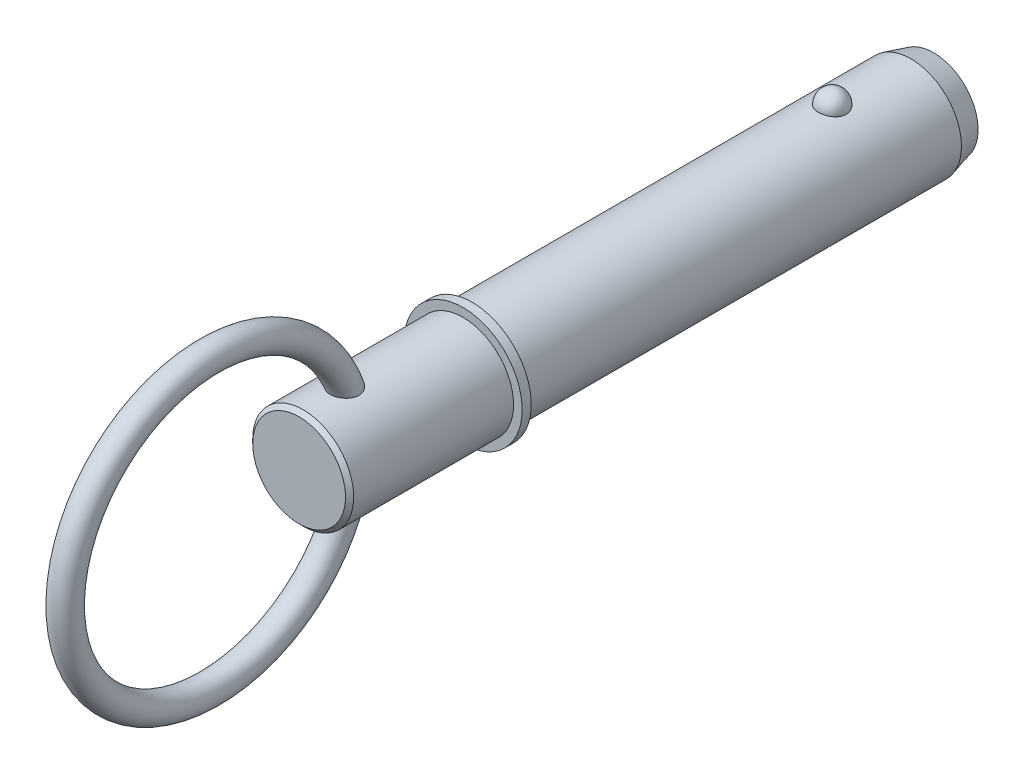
from build123d import *

# Parameters (mm, degrees)
SKETCH2_R           = 11.115
BOSS_EXTRUDE1_DEPTH = 76.2
BOSS_EXTRUDE2_START = 25.4
SKETCH3_R           = 11.115
BOSS_EXTRUDE2_DEPTH = 25.4
CHAMFER1_SIZE       = 5
CHAMFER1_SIZE2      = 1.339745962
SKETCH20_W          = 2
SKETCH20_H          = 13
SKETCH21_R          = 11.115
BOSS_EXTRUDE3_DEPTH = 38.1
CHAMFER2_SIZE       = 0.9
SKETCH24_R          = 3


with BuildPart() as part:
    # Sketch2 → Boss-Extrude1 (new body)
    with BuildSketch(Plane.XY):
        with Locations(Location((0, 0, 0), (0, 0, 180))):
            Circle(SKETCH2_R)
    extrude(amount=BOSS_EXTRUDE1_DEPTH)

    # Sketch3 → Boss-Extrude2 (add)
    with BuildSketch(Plane(origin=(0, 0, 0), x_dir=(-1, 0, 0), z_dir=(0, 0, -1)).offset(BOSS_EXTRUDE2_START)):
        Circle(SKETCH3_R)
    extrude(amount=-BOSS_EXTRUDE2_DEPTH)

    # Chamfer1
    chamfer1_edges = [part.edges().sort_by_distance(p)[0] for p in [
        (11.115, 0, -25.4),
    ]]
    chamfer1_side = [part.faces().sort_by_distance(p)[0] for p in [
        (11.115, 0, 25.4),
    ]]
    chamfer(chamfer1_edges, length=CHAMFER1_SIZE, length2=CHAMFER1_SIZE2, reference=chamfer1_side[0])

    # Sketch18 → Revolve1 (revolve)
    with BuildSketch(Plane(origin=(0, 0, 0), x_dir=(0, 0, -1), z_dir=(1, 0, 0))):
        with BuildLine():
            Line((3.07, 14.185), (3.07, 8.045))
            ThreePointArc((3.07, 8.045), (0, 11.115), (3.07, 14.185))
        make_face()
    revolve(axis=Axis((0, 14.185, -3.07), (0, -1, 0)))

    # Sketch20 → Revolve2 (revolve)
    with BuildSketch(Plane(origin=(0, 0, 0), x_dir=(0, 0, -1), z_dir=(1, 0, 0)), mode=Mode.PRIVATE) as revolve2_sk:
        with Locations((-77.2, 6.5)):
            Rectangle(SKETCH20_W, SKETCH20_H)
    revolve(revolve2_sk.sketch.rotate(Axis((0, 0, 33.728787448), (0, 0, 1)), 90), axis=Axis((0, 0, 33.728787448), (0, 0, 1)))

    # Sketch21 → Boss-Extrude3 (add)
    with BuildSketch(Plane(origin=(0, 0, 76.2), x_dir=(-1, 0, 0), z_dir=(0, 0, -1))):
        Circle(SKETCH21_R)
    extrude(amount=-BOSS_EXTRUDE3_DEPTH)

    # Chamfer2
    chamfer2_edges = [part.edges().sort_by_distance(p)[0] for p in [
        (11.115, 0, 114.3),
    ]]
    chamfer(chamfer2_edges, length=CHAMFER2_SIZE)

    # Sweep1: sweep along a path in Sketch23
    with BuildLine(Plane(origin=(0, 0, 0), x_dir=(0, 0, -1), z_dir=(1, 0, 0))) as sweep1_path:
        CenterArc((-134.05, 0), 31.75, 0, 360)
    # Sketch24 → Sweep1 (sweep)
    with BuildSketch(Plane(origin=(0, 0, 0), x_dir=(1, 0, 0), z_dir=(0, 1, 0))):
        with Locations((0, -102.3)):
            Circle(SKETCH24_R)
    sweep(path=sweep1_path.line)


solid = part.part
